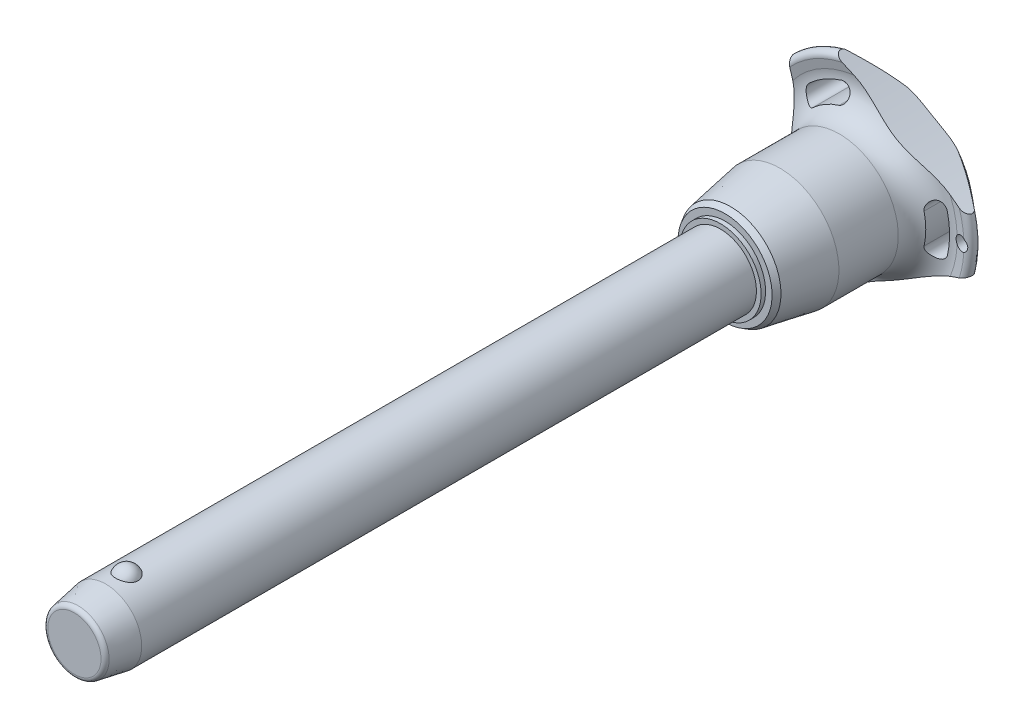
from build123d import *

# Parameters (mm, degrees)
SKETCH1_R           = 8
BOSS_EXTRUDE1_DEPTH = 130
SKETCH2_R           = 7
BOSS_EXTRUDE2_DEPTH = 39.7
BOSS_EXTRUDE3_START = 14
SKETCH1_2_R         = 8
BOSS_EXTRUDE3_DEPTH = 14
CHAMFER1_SIZE       = 7
CHAMFER1_SIZE2      = 1.234288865
FILLET1_R           = 1
SKETCH6_R           = 144.275
CUT_EXTRUDE1_DEPTH  = 174.008618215
CIRPATTERN1_COUNT   = 3
SKETCH7_R           = 1.5
CUT_EXTRUDE2_DEPTH  = 173.892579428


with BuildPart() as part:
    # Sketch1 → Boss-Extrude1 (new body)
    with BuildSketch(Plane.XY):
        Circle(SKETCH1_R)
    extrude(amount=-BOSS_EXTRUDE1_DEPTH)

    # Sketch2 → Boss-Extrude2 (add)
    with BuildSketch(Plane(origin=(0, 0, -130), x_dir=(-1, 0, 0), z_dir=(0, 0, -1))):
        Circle(SKETCH2_R)
    extrude(amount=BOSS_EXTRUDE2_DEPTH)

    # Sketch3 → Revolve1 (revolve)
    with BuildSketch(Plane(origin=(0, 0, 0), x_dir=(0, 0, -1), z_dir=(1, 0, 0))):
        with BuildLine():
            Line((-2.387467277, 9.5), (-2.387467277, 4.2))
            ThreePointArc((-2.387467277, 4.2), (0.262532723, 6.85), (-2.387467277, 9.5))
        make_face()
        with BuildLine():
            Line((-2.387467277, -4.2), (-2.387467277, -9.5))
            ThreePointArc((-2.387467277, -9.5), (0.262532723, -6.85), (-2.387467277, -4.2))
        make_face()
    revolve(axis=Axis((0, -4.2, 2.387467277), (0, 1, 0)))

    # Sketch1_2 → Boss-Extrude3 (add)
    with BuildSketch(Plane.XY.offset(BOSS_EXTRUDE3_START)):
        Circle(SKETCH1_2_R)
    extrude(amount=-BOSS_EXTRUDE3_DEPTH)

    # Chamfer1
    chamfer1_edges = [part.edges().sort_by_distance(p)[0] for p in [
        (-8, 0, 14),
    ]]
    chamfer1_side = [part.faces().sort_by_distance(p)[0] for p in [
        (-8, 0, -58),
    ]]
    chamfer(chamfer1_edges, length=CHAMFER1_SIZE, length2=CHAMFER1_SIZE2, reference=chamfer1_side[0])

    # Fillet1
    fillet1_edges = [part.edges().sort_by_distance(p)[0] for p in [
        (-6.765711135, 0, 14),
        (7, 0, -169.7),
    ]]
    fillet(fillet1_edges, radius=FILLET1_R)

    # Sketch4 → Revolve2 (revolve)
    with BuildSketch(Plane(origin=(0, 0, 0), x_dir=(0, 0, -1), z_dir=(1, 0, 0)), mode=Mode.PRIVATE) as revolve2_sk:
        Polygon((130, 0), (130, 9.044607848), (131, 9.044607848), (131, 10.490707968), (132.25235944, 11.213758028), (143.233333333, 13.15), (156.466666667, 13.15), (156.466666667, 0), align=None)
    revolve(revolve2_sk.sketch.rotate(Axis((0, 0, -156.466666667), (0, 0, 1)), 90), axis=Axis((0, 0, -156.466666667), (0, 0, 1)))

    # Sketch5 → Revolve3 (revolve)
    with BuildSketch(Plane(origin=(0, 0, 0), x_dir=(0, 0, -1), z_dir=(1, 0, 0)), mode=Mode.PRIVATE) as revolve3_sk:
        with BuildLine():
            Line((162.32877039, 20.428960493), (161.910912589, 22.344207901))
            ThreePointArc((161.910912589, 22.344207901), (162.554394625, 23.677136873), (164.002586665, 23.371345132))
            Line((164.002586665, 23.371345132), (169.141488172, 17.247040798))
            ThreePointArc((169.141488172, 17.247040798), (169.7, 15.584758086), (168.978803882, 13.986322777))
            ThreePointArc((168.978803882, 13.986322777), (164.617427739, 7.589034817), (163.083333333, 0))
            Line((163.083333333, 0), (156.466666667, 0))
            Line((156.466666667, 0), (156.466666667, 13.15))
            ThreePointArc((156.466666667, 13.15), (161.139661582, 15.38660811), (162.32877039, 20.428960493))
        make_face()
    revolve(revolve3_sk.sketch.rotate(Axis((0, 0, -163.083333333), (0, 0, 1)), 90), axis=Axis((0, 0, -163.083333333), (0, 0, 1)))

    # Sketch6 → Cut-Extrude1 (cut, through all)
    with BuildSketch(Plane.XY):
        with Locations((-159.975, 0)):
            Circle(SKETCH6_R)
        with BuildLine():
            ThreePointArc((18.131206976, -4.190753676), (18.60922037, 0), (18.131206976, 4.190753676))
            ThreePointArc((18.131206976, 4.190753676), (15.94840906, 5.553949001), (14.585213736, 3.371151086))
            ThreePointArc((14.585213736, 3.371151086), (14.969740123, 0), (14.585213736, -3.371151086))
            ThreePointArc((14.585213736, -3.371151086), (15.94840906, -5.553949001), (18.131206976, -4.190753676))
        make_face()
    cut_extrude1 = extrude(amount=-CUT_EXTRUDE1_DEPTH, mode=Mode.SUBTRACT)

    # CirPattern1: Cut-Extrude1 ×3 about axis
    cirpattern1_axis = Axis((0, 0, 0), (0, 0, 1))
    for i in range(1, CIRPATTERN1_COUNT):
        add(cut_extrude1.rotate(cirpattern1_axis, i * 360 / CIRPATTERN1_COUNT), mode=Mode.SUBTRACT)

    # Sketch7 → Cut-Extrude2 (cut, through all)
    with BuildSketch(Plane.XY):
        with Locations(Location((21.60922037, 0, 0), (0, 0, 297.620773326))):
            Circle(SKETCH7_R)
    extrude(amount=-CUT_EXTRUDE2_DEPTH, mode=Mode.SUBTRACT)


solid = part.part
